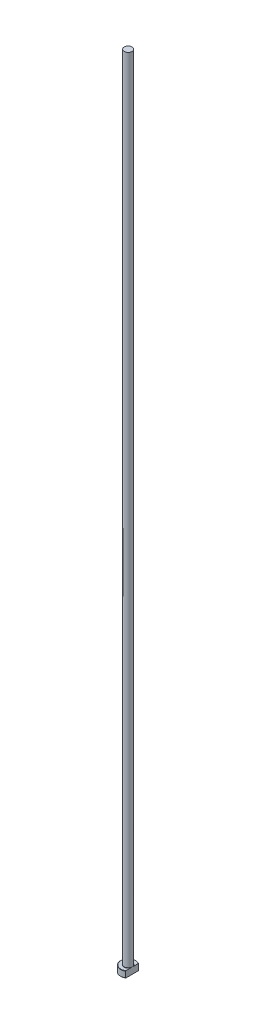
ISO-10303-21;
HEADER;
FILE_DESCRIPTION(('STEP AP214'),'2;1');
FILE_NAME('part.step','',(''),(''),'','','');
FILE_SCHEMA(('AUTOMOTIVE_DESIGN { 1 0 10303 214 1 1 1 1 }'));
ENDSEC;
DATA;
#1=APPLICATION_CONTEXT('core data for automotive mechanical design processes');
#2=APPLICATION_PROTOCOL_DEFINITION('international standard','automotive_design',2000,#1);
#3=PRODUCT_CONTEXT('',#1,'mechanical');
#4=PRODUCT('Part','Part','',(#3));
#5=PRODUCT_RELATED_PRODUCT_CATEGORY('part','',(#4));
#6=PRODUCT_DEFINITION_FORMATION('','',#4);
#7=PRODUCT_DEFINITION_CONTEXT('part definition',#1,'design');
#8=PRODUCT_DEFINITION('design','',#6,#7);
#9=PRODUCT_DEFINITION_SHAPE('','',#8);
#10=(LENGTH_UNIT() NAMED_UNIT(*) SI_UNIT(.MILLI.,.METRE.));
#11=(NAMED_UNIT(*) PLANE_ANGLE_UNIT() SI_UNIT($,.RADIAN.));
#12=(NAMED_UNIT(*) SI_UNIT($,.STERADIAN.) SOLID_ANGLE_UNIT());
#13=UNCERTAINTY_MEASURE_WITH_UNIT(LENGTH_MEASURE(1.E-05),#10,'distance_accuracy_value','');
#14=(GEOMETRIC_REPRESENTATION_CONTEXT(3) GLOBAL_UNCERTAINTY_ASSIGNED_CONTEXT((#13)) GLOBAL_UNIT_ASSIGNED_CONTEXT((#10,
#11,#12)) REPRESENTATION_CONTEXT('',''));
#15=CARTESIAN_POINT('',(0.,0.,0.));
#16=DIRECTION('',(0.,0.,1.));
#17=DIRECTION('',(1.,0.,0.));
#18=AXIS2_PLACEMENT_3D('',#15,#16,#17);
#19=CARTESIAN_POINT('',(0.,0.,0.));
#20=DIRECTION('',(0.,-1.,0.));
#21=DIRECTION('',(0.,0.,-1.));
#22=AXIS2_PLACEMENT_3D('',#19,#20,#21);
#23=PLANE('',#22);
#24=CARTESIAN_POINT('',(0.,0.,0.));
#25=DIRECTION('',(0.,-1.,0.));
#26=DIRECTION('',(0.,0.,-1.));
#27=AXIS2_PLACEMENT_3D('',#24,#25,#26);
#28=CIRCLE('',#27,5.79999999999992);
#29=CARTESIAN_POINT('',(3.09999999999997,0.,4.90204039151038));
#30=VERTEX_POINT('',#29);
#31=CARTESIAN_POINT('',(3.09999999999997,0.,-4.90204039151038));
#32=VERTEX_POINT('',#31);
#33=EDGE_CURVE('E98',#30,#32,#28,.T.);
#34=ORIENTED_EDGE('',*,*,#33,.T.);
#35=DIRECTION('',(0.,0.,1.));
#36=VECTOR('',#35,1.);
#37=CARTESIAN_POINT('',(3.09999999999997,0.,-5.13711981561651));
#38=LINE('',#37,#36);
#39=EDGE_CURVE('E83',#32,#30,#38,.T.);
#40=ORIENTED_EDGE('',*,*,#39,.T.);
#41=EDGE_LOOP('',(#34,#40));
#42=FACE_BOUND('',#41,.T.);
#43=ADVANCED_FACE('F32',(#42),#23,.T.);
#44=CARTESIAN_POINT('',(0.,259.958771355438,0.));
#45=DIRECTION('',(0.,1.,0.));
#46=DIRECTION('',(0.,0.,1.));
#47=AXIS2_PLACEMENT_3D('',#44,#45,#46);
#48=CYLINDRICAL_SURFACE('',#47,5.99999999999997);
#49=CARTESIAN_POINT('',(0.,4.80000000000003,0.));
#50=DIRECTION('',(0.,1.,0.));
#51=DIRECTION('',(0.,0.,1.));
#52=AXIS2_PLACEMENT_3D('',#49,#50,#51);
#53=CIRCLE('',#52,5.99999999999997);
#54=CARTESIAN_POINT('',(3.09999999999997,4.80000000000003,5.13711981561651));
#55=VERTEX_POINT('',#54);
#56=CARTESIAN_POINT('',(3.09999999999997,4.80000000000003,-5.13711981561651));
#57=VERTEX_POINT('',#56);
#58=EDGE_CURVE('E104',#55,#57,#53,.F.);
#59=ORIENTED_EDGE('',*,*,#58,.T.);
#60=DIRECTION('',(0.,-1.,0.));
#61=VECTOR('',#60,1.);
#62=CARTESIAN_POINT('',(3.09999999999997,630.,-5.13711981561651));
#63=LINE('',#62,#61);
#64=CARTESIAN_POINT('',(3.09999999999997,0.200000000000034,-5.13711981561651));
#65=VERTEX_POINT('',#64);
#66=EDGE_CURVE('E183',#57,#65,#63,.T.);
#67=ORIENTED_EDGE('',*,*,#66,.T.);
#68=CARTESIAN_POINT('',(0.,0.200000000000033,0.));
#69=DIRECTION('',(0.,-1.,0.));
#70=DIRECTION('',(0.,0.,-1.));
#71=AXIS2_PLACEMENT_3D('',#68,#69,#70);
#72=CIRCLE('',#71,5.99999999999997);
#73=CARTESIAN_POINT('',(3.09999999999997,0.200000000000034,5.13711981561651));
#74=VERTEX_POINT('',#73);
#75=EDGE_CURVE('E100',#65,#74,#72,.F.);
#76=ORIENTED_EDGE('',*,*,#75,.T.);
#77=DIRECTION('',(0.,-1.,0.));
#78=VECTOR('',#77,1.);
#79=CARTESIAN_POINT('',(3.09999999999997,630.,5.13711981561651));
#80=LINE('',#79,#78);
#81=EDGE_CURVE('E93',#55,#74,#80,.T.);
#82=ORIENTED_EDGE('',*,*,#81,.F.);
#83=EDGE_LOOP('',(#59,#67,#76,#82));
#84=FACE_BOUND('',#83,.T.);
#85=ADVANCED_FACE('F158',(#84),#48,.T.);
#86=CARTESIAN_POINT('',(-5.99999999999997,5.,0.));
#87=DIRECTION('',(0.,1.,0.));
#88=DIRECTION('',(0.,0.,1.));
#89=AXIS2_PLACEMENT_3D('',#86,#87,#88);
#90=PLANE('',#89);
#91=CARTESIAN_POINT('',(0.,5.,0.));
#92=DIRECTION('',(0.,1.,0.));
#93=DIRECTION('',(0.,0.,1.));
#94=AXIS2_PLACEMENT_3D('',#91,#92,#93);
#95=CIRCLE('',#94,5.79999999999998);
#96=CARTESIAN_POINT('',(3.09999999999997,5.,-4.90204039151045));
#97=VERTEX_POINT('',#96);
#98=CARTESIAN_POINT('',(3.09999999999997,5.,4.90204039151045));
#99=VERTEX_POINT('',#98);
#100=EDGE_CURVE('E178',#97,#99,#95,.T.);
#101=ORIENTED_EDGE('',*,*,#100,.T.);
#102=DIRECTION('',(0.,0.,-1.));
#103=VECTOR('',#102,1.);
#104=CARTESIAN_POINT('',(3.09999999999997,5.,0.));
#105=LINE('',#104,#103);
#106=CARTESIAN_POINT('',(3.09999999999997,4.99999999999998,1.13137084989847));
#107=VERTEX_POINT('',#106);
#108=EDGE_CURVE('E57',#99,#107,#105,.T.);
#109=ORIENTED_EDGE('',*,*,#108,.T.);
#110=CARTESIAN_POINT('',(0.,5.,0.));
#111=DIRECTION('',(0.,1.,0.));
#112=DIRECTION('',(0.,0.,1.));
#113=AXIS2_PLACEMENT_3D('',#110,#111,#112);
#114=CIRCLE('',#113,3.29999999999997);
#115=CARTESIAN_POINT('',(3.09999999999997,4.99999999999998,-1.13137084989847));
#116=VERTEX_POINT('',#115);
#117=EDGE_CURVE('E107',#107,#116,#114,.F.);
#118=ORIENTED_EDGE('',*,*,#117,.T.);
#119=EDGE_CURVE('E136',#116,#97,#105,.T.);
#120=ORIENTED_EDGE('',*,*,#119,.T.);
#121=EDGE_LOOP('',(#101,#109,#118,#120));
#122=FACE_BOUND('',#121,.T.);
#123=ADVANCED_FACE('F147',(#122),#90,.T.);
#124=CARTESIAN_POINT('',(0.,5.,0.));
#125=DIRECTION('',(0.,-1.,0.));
#126=DIRECTION('',(0.,0.,-1.));
#127=AXIS2_PLACEMENT_3D('',#124,#125,#126);
#128=CONICAL_SURFACE('',#127,5.79999999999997,0.785398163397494);
#129=ORIENTED_EDGE('',*,*,#58,.F.);
#130=CARTESIAN_POINT('',(3.09999999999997,-0.920431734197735,11.3030314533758));
#131=CARTESIAN_POINT('',(3.09999999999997,-0.688619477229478,11.0626468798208));
#132=CARTESIAN_POINT('',(3.09999999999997,-0.457063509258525,10.8220144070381));
#133=CARTESIAN_POINT('',(3.09999999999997,0.00539791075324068,10.3401205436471));
#134=CARTESIAN_POINT('',(3.09999999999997,0.236303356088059,10.0988591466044));
#135=CARTESIAN_POINT('',(3.09999999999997,0.69741098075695,9.61548494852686));
#136=CARTESIAN_POINT('',(3.09999999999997,0.927612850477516,9.3733718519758));
#137=CARTESIAN_POINT('',(3.09999999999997,1.38702344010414,8.88820676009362));
#138=CARTESIAN_POINT('',(3.09999999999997,1.61623216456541,8.64515476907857));
#139=CARTESIAN_POINT('',(3.09999999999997,2.06943803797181,8.16208218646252));
#140=CARTESIAN_POINT('',(3.09999999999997,2.29345676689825,7.92208185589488));
#141=CARTESIAN_POINT('',(3.09999999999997,2.73992554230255,7.4406269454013));
#142=CARTESIAN_POINT('',(3.09999999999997,2.96237559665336,7.19917237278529));
#143=CARTESIAN_POINT('',(3.09999999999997,3.40516728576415,6.71440911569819));
#144=CARTESIAN_POINT('',(3.09999999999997,3.6255092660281,6.47110074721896));
#145=CARTESIAN_POINT('',(3.09999999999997,4.06338097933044,5.98197014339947));
#146=CARTESIAN_POINT('',(3.09999999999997,4.28091078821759,5.736147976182));
#147=CARTESIAN_POINT('',(3.09999999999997,4.64723250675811,5.31542741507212));
#148=CARTESIAN_POINT('',(3.09999999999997,4.79703819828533,5.14141294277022));
#149=CARTESIAN_POINT('',(3.09999999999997,5.09412273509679,4.7912056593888));
#150=CARTESIAN_POINT('',(3.09999999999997,5.24140133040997,4.61501263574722));
#151=CARTESIAN_POINT('',(3.09999999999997,5.5340047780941,4.25808346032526));
#152=CARTESIAN_POINT('',(3.09999999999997,5.67929603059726,4.07731963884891));
#153=CARTESIAN_POINT('',(3.09999999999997,5.96506147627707,3.71208453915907));
#154=CARTESIAN_POINT('',(3.09999999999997,6.10553688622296,3.52761421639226));
#155=CARTESIAN_POINT('',(3.09999999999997,6.38162972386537,3.15098880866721));
#156=CARTESIAN_POINT('',(3.09999999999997,6.5171507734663,2.95876205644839));
#157=CARTESIAN_POINT('',(3.09999999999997,6.71260042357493,2.66498269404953));
#158=CARTESIAN_POINT('',(3.09999999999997,6.77649142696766,2.56607098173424));
#159=CARTESIAN_POINT('',(3.09999999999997,6.90093996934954,2.36617934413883));
#160=CARTESIAN_POINT('',(3.09999999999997,6.96149785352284,2.26519963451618));
#161=CARTESIAN_POINT('',(3.09999999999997,7.07778312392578,2.06197879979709));
#162=CARTESIAN_POINT('',(3.09999999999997,7.13355741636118,1.9597648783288));
#163=CARTESIAN_POINT('',(3.09999999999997,7.23993773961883,1.75269687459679));
#164=CARTESIAN_POINT('',(3.09999999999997,7.29054278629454,1.64784229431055));
#165=CARTESIAN_POINT('',(3.09999999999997,7.43232844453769,1.329374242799));
#166=CARTESIAN_POINT('',(3.09999999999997,7.51393038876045,1.11110705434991));
#167=CARTESIAN_POINT('',(3.09999999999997,7.60389052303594,0.78418122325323));
#168=CARTESIAN_POINT('',(3.09999999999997,7.62802295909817,0.679829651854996));
#169=CARTESIAN_POINT('',(3.09999999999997,7.66638713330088,0.46928482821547));
#170=CARTESIAN_POINT('',(3.09999999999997,7.68061997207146,0.363091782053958));
#171=CARTESIAN_POINT('',(3.09999999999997,7.69816738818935,0.150218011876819));
#172=CARTESIAN_POINT('',(3.09999999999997,7.70152516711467,0.0435409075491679));
#173=CARTESIAN_POINT('',(3.09999999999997,7.69719360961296,-0.169591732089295));
#174=CARTESIAN_POINT('',(3.09999999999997,7.68950359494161,-0.276047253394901));
#175=CARTESIAN_POINT('',(3.09999999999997,7.66373252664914,-0.486880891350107));
#176=CARTESIAN_POINT('',(3.09999999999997,7.64572733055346,-0.591268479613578));
#177=CARTESIAN_POINT('',(3.09999999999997,7.60052536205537,-0.798013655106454));
#178=CARTESIAN_POINT('',(3.09999999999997,7.57332729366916,-0.900370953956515));
#179=CARTESIAN_POINT('',(3.09999999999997,7.51094394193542,-1.10330613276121));
#180=CARTESIAN_POINT('',(3.09999999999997,7.47570859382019,-1.20386840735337));
#181=CARTESIAN_POINT('',(3.09999999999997,7.39875968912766,-1.40242722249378));
#182=CARTESIAN_POINT('',(3.09999999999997,7.35704736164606,-1.50042424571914));
#183=CARTESIAN_POINT('',(3.09999999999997,7.22811120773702,-1.78198575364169));
#184=CARTESIAN_POINT('',(3.09999999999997,7.13397777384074,-1.96237556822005));
#185=CARTESIAN_POINT('',(3.09999999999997,6.93309444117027,-2.31605883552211));
#186=CARTESIAN_POINT('',(3.09999999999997,6.82632930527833,-2.48934337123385));
#187=CARTESIAN_POINT('',(3.09999999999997,6.60386158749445,-2.83097436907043));
#188=CARTESIAN_POINT('',(3.09999999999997,6.48812633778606,-2.99929937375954));
#189=CARTESIAN_POINT('',(3.09999999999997,6.2507350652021,-3.33155975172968));
#190=CARTESIAN_POINT('',(3.09999999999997,6.12908188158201,-3.49549717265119));
#191=CARTESIAN_POINT('',(3.09999999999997,5.87989164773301,-3.82213838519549));
#192=CARTESIAN_POINT('',(3.09999999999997,5.75229938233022,-3.98479985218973));
#193=CARTESIAN_POINT('',(3.09999999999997,5.49383773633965,-4.30751445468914));
#194=CARTESIAN_POINT('',(3.09999999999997,5.36296802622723,-4.46756732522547));
#195=CARTESIAN_POINT('',(3.09999999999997,5.09906242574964,-4.78523580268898));
#196=CARTESIAN_POINT('',(3.09999999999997,4.96603235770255,-4.94285625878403));
#197=CARTESIAN_POINT('',(3.09999999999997,4.69805373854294,-5.25645943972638));
#198=CARTESIAN_POINT('',(3.09999999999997,4.56310515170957,-5.41244213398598));
#199=CARTESIAN_POINT('',(3.09999999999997,4.2080943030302,-5.81877937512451));
#200=CARTESIAN_POINT('',(3.09999999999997,3.98681570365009,-6.06807041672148));
#201=CARTESIAN_POINT('',(3.09999999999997,3.54147161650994,-6.56415415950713));
#202=CARTESIAN_POINT('',(3.09999999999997,3.31740605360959,-6.8109467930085));
#203=CARTESIAN_POINT('',(3.09999999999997,2.86701901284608,-7.30287446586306));
#204=CARTESIAN_POINT('',(3.09999999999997,2.64069567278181,-7.54800779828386));
#205=CARTESIAN_POINT('',(3.09999999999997,2.18649425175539,-8.0368296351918));
#206=CARTESIAN_POINT('',(3.09999999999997,1.95861616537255,-8.28051813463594));
#207=CARTESIAN_POINT('',(3.09999999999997,1.5108345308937,-8.75699429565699));
#208=CARTESIAN_POINT('',(3.09999999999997,1.29097841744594,-8.98982656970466));
#209=CARTESIAN_POINT('',(3.09999999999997,0.850379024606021,-9.4546514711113));
#210=CARTESIAN_POINT('',(3.09999999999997,0.629635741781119,-9.68664409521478));
#211=CARTESIAN_POINT('',(3.09999999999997,0.187673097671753,-10.1496925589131));
#212=CARTESIAN_POINT('',(3.09999999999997,-0.0335454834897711,-10.3807491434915));
#213=CARTESIAN_POINT('',(3.09999999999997,-0.476574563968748,-10.8422904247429));
#214=CARTESIAN_POINT('',(3.09999999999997,-0.698385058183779,-11.0727751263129));
#215=CARTESIAN_POINT('',(3.09999999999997,-0.920431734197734,-11.3030314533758));
#216=B_SPLINE_CURVE_WITH_KNOTS('',3,(#130,#131,#132,#133,#134,#135,#136,#137,#138,#139,#140,
#141,#142,#143,#144,#145,#146,#147,#148,#149,#150,#151,#152,#153,#154,#155,#156,#157,#158,#159,
#160,#161,#162,#163,#164,#165,#166,#167,#168,#169,#170,#171,#172,#173,#174,#175,#176,#177,#178,
#179,#180,#181,#182,#183,#184,#185,#186,#187,#188,#189,#190,#191,#192,#193,#194,#195,#196,#197,
#198,#199,#200,#201,#202,#203,#204,#205,#206,#207,#208,#209,#210,#211,#212,#213,#214,#215),
.UNSPECIFIED.,.F.,.F.,(4,2,2,2,2,2,2,2,2,2,2,2,2,2,2,2,2,2,2,2,2,2,2,2,2,2,2,2,2,2,2,2,2,2,2,2,
2,2,2,2,2,2,4),(0.,1.00184641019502,2.00370311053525,3.00595078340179,4.00819385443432,
4.9931053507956,5.97801190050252,6.9627541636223,7.94746981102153,8.6362949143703,
9.32518776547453,10.0208755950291,10.7163863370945,11.421700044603,11.7749044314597,
12.1280721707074,12.4772435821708,12.8264813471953,13.5223439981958,13.8432758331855,
14.1641719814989,14.4837917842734,14.8034312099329,15.1207496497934,15.4381128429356,
15.7575096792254,16.0768459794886,16.6863983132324,17.296693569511,17.9093265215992,
18.5216683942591,19.1418114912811,19.7620171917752,20.3807633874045,20.9995211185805,
21.9994842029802,22.9994743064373,24.0003716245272,25.0012724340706,25.961961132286,
26.9226535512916,27.882299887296,28.8419379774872),.UNSPECIFIED.);
#217=EDGE_CURVE('E135',#55,#99,#216,.T.);
#218=ORIENTED_EDGE('',*,*,#217,.T.);
#219=ORIENTED_EDGE('',*,*,#100,.F.);
#220=EDGE_CURVE('E127',#97,#57,#216,.T.);
#221=ORIENTED_EDGE('',*,*,#220,.T.);
#222=EDGE_LOOP('',(#129,#218,#219,#221));
#223=FACE_BOUND('',#222,.T.);
#224=ADVANCED_FACE('F143',(#223),#128,.T.);
#225=CARTESIAN_POINT('',(0.,0.200000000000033,0.));
#226=DIRECTION('',(0.,1.,0.));
#227=DIRECTION('',(0.,0.,1.));
#228=AXIS2_PLACEMENT_3D('',#225,#226,#227);
#229=CONICAL_SURFACE('',#228,5.99999999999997,0.785398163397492);
#230=ORIENTED_EDGE('',*,*,#75,.F.);
#231=CARTESIAN_POINT('',(3.09999999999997,5.92043173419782,-11.3030314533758));
#232=CARTESIAN_POINT('',(3.09999999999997,5.68861947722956,-11.0626468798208));
#233=CARTESIAN_POINT('',(3.09999999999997,5.45706350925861,-10.8220144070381));
#234=CARTESIAN_POINT('',(3.09999999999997,4.99460208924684,-10.3401205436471));
#235=CARTESIAN_POINT('',(3.09999999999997,4.76369664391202,-10.0988591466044));
#236=CARTESIAN_POINT('',(3.09999999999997,4.30258901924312,-9.61548494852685));
#237=CARTESIAN_POINT('',(3.09999999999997,4.07238714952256,-9.37337185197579));
#238=CARTESIAN_POINT('',(3.09999999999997,3.61297655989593,-8.88820676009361));
#239=CARTESIAN_POINT('',(3.09999999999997,3.38376783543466,-8.64515476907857));
#240=CARTESIAN_POINT('',(3.09999999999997,2.93056196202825,-8.16208218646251));
#241=CARTESIAN_POINT('',(3.09999999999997,2.70654323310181,-7.92208185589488));
#242=CARTESIAN_POINT('',(3.09999999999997,2.26007445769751,-7.4406269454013));
#243=CARTESIAN_POINT('',(3.09999999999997,2.03762440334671,-7.19917237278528));
#244=CARTESIAN_POINT('',(3.09999999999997,1.5948327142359,-6.71440911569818));
#245=CARTESIAN_POINT('',(3.09999999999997,1.37449073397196,-6.47110074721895));
#246=CARTESIAN_POINT('',(3.09999999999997,0.936619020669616,-5.98197014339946));
#247=CARTESIAN_POINT('',(3.09999999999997,0.719089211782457,-5.73614797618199));
#248=CARTESIAN_POINT('',(3.09999999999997,0.352767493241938,-5.31542741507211));
#249=CARTESIAN_POINT('',(3.09999999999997,0.202961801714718,-5.14141294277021));
#250=CARTESIAN_POINT('',(3.09999999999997,-0.0941227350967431,-4.79120565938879));
#251=CARTESIAN_POINT('',(3.09999999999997,-0.241401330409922,-4.61501263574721));
#252=CARTESIAN_POINT('',(3.09999999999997,-0.534004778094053,-4.25808346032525));
#253=CARTESIAN_POINT('',(3.09999999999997,-0.679296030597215,-4.0773196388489));
#254=CARTESIAN_POINT('',(3.09999999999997,-0.965061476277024,-3.71208453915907));
#255=CARTESIAN_POINT('',(3.09999999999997,-1.10553688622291,-3.52761421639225));
#256=CARTESIAN_POINT('',(3.09999999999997,-1.38162972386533,-3.1509888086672));
#257=CARTESIAN_POINT('',(3.09999999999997,-1.51715077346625,-2.95876205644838));
#258=CARTESIAN_POINT('',(3.09999999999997,-1.71260042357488,-2.66498269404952));
#259=CARTESIAN_POINT('',(3.09999999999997,-1.77649142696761,-2.56607098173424));
#260=CARTESIAN_POINT('',(3.09999999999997,-1.90093996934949,-2.36617934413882));
#261=CARTESIAN_POINT('',(3.09999999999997,-1.96149785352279,-2.26519963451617));
#262=CARTESIAN_POINT('',(3.09999999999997,-2.07778312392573,-2.06197879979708));
#263=CARTESIAN_POINT('',(3.09999999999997,-2.13355741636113,-1.95976487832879));
#264=CARTESIAN_POINT('',(3.09999999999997,-2.23993773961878,-1.75269687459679));
#265=CARTESIAN_POINT('',(3.09999999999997,-2.29054278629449,-1.64784229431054));
#266=CARTESIAN_POINT('',(3.09999999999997,-2.43232844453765,-1.32937424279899));
#267=CARTESIAN_POINT('',(3.09999999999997,-2.5139303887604,-1.1111070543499));
#268=CARTESIAN_POINT('',(3.09999999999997,-2.60389052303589,-0.784181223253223));
#269=CARTESIAN_POINT('',(3.09999999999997,-2.62802295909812,-0.67982965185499));
#270=CARTESIAN_POINT('',(3.09999999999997,-2.66638713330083,-0.469284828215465));
#271=CARTESIAN_POINT('',(3.09999999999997,-2.68061997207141,-0.363091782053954));
#272=CARTESIAN_POINT('',(3.09999999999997,-2.6981673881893,-0.150218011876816));
#273=CARTESIAN_POINT('',(3.09999999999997,-2.70152516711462,-0.0435409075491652));
#274=CARTESIAN_POINT('',(3.09999999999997,-2.69719360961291,0.169591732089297));
#275=CARTESIAN_POINT('',(3.09999999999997,-2.68950359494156,0.276047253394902));
#276=CARTESIAN_POINT('',(3.09999999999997,-2.66373252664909,0.486880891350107));
#277=CARTESIAN_POINT('',(3.09999999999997,-2.64572733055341,0.591268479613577));
#278=CARTESIAN_POINT('',(3.09999999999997,-2.60052536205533,0.798013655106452));
#279=CARTESIAN_POINT('',(3.09999999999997,-2.57332729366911,0.900370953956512));
#280=CARTESIAN_POINT('',(3.09999999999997,-2.51094394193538,1.10330613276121));
#281=CARTESIAN_POINT('',(3.09999999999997,-2.47570859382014,1.20386840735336));
#282=CARTESIAN_POINT('',(3.09999999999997,-2.39875968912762,1.40242722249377));
#283=CARTESIAN_POINT('',(3.09999999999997,-2.35704736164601,1.50042424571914));
#284=CARTESIAN_POINT('',(3.09999999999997,-2.22811120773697,1.78198575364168));
#285=CARTESIAN_POINT('',(3.09999999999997,-2.1339777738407,1.96237556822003));
#286=CARTESIAN_POINT('',(3.09999999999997,-1.93309444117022,2.31605883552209));
#287=CARTESIAN_POINT('',(3.09999999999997,-1.82632930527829,2.48934337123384));
#288=CARTESIAN_POINT('',(3.09999999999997,-1.60386158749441,2.83097436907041));
#289=CARTESIAN_POINT('',(3.09999999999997,-1.48812633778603,2.99929937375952));
#290=CARTESIAN_POINT('',(3.09999999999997,-1.25073506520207,3.33155975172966));
#291=CARTESIAN_POINT('',(3.09999999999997,-1.12908188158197,3.49549717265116));
#292=CARTESIAN_POINT('',(3.09999999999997,-0.879891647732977,3.82213838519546));
#293=CARTESIAN_POINT('',(3.09999999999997,-0.752299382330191,3.9847998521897));
#294=CARTESIAN_POINT('',(3.09999999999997,-0.493837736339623,4.3075144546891));
#295=CARTESIAN_POINT('',(3.09999999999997,-0.362968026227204,4.46756732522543));
#296=CARTESIAN_POINT('',(3.09999999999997,-0.0990624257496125,4.78523580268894));
#297=CARTESIAN_POINT('',(3.09999999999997,0.0339676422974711,4.94285625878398));
#298=CARTESIAN_POINT('',(3.09999999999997,0.301946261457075,5.25645943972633));
#299=CARTESIAN_POINT('',(3.09999999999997,0.436894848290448,5.41244213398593));
#300=CARTESIAN_POINT('',(3.09999999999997,0.791905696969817,5.81877937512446));
#301=CARTESIAN_POINT('',(3.09999999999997,1.01318429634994,6.06807041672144));
#302=CARTESIAN_POINT('',(3.09999999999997,1.45852838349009,6.56415415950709));
#303=CARTESIAN_POINT('',(3.09999999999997,1.68259394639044,6.81094679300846));
#304=CARTESIAN_POINT('',(3.09999999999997,2.13298098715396,7.30287446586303));
#305=CARTESIAN_POINT('',(3.09999999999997,2.35930432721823,7.54800779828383));
#306=CARTESIAN_POINT('',(3.09999999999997,2.81350574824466,8.03682963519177));
#307=CARTESIAN_POINT('',(3.09999999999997,3.0413838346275,8.28051813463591));
#308=CARTESIAN_POINT('',(3.09999999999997,3.48916546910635,8.75699429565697));
#309=CARTESIAN_POINT('',(3.09999999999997,3.70902158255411,8.98982656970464));
#310=CARTESIAN_POINT('',(3.09999999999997,4.14962097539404,9.45465147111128));
#311=CARTESIAN_POINT('',(3.09999999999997,4.37036425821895,9.68664409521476));
#312=CARTESIAN_POINT('',(3.09999999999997,4.81232690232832,10.1496925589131));
#313=CARTESIAN_POINT('',(3.09999999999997,5.03354548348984,10.3807491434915));
#314=CARTESIAN_POINT('',(3.09999999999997,5.47657456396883,10.8422904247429));
#315=CARTESIAN_POINT('',(3.09999999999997,5.69838505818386,11.0727751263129));
#316=CARTESIAN_POINT('',(3.09999999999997,5.92043173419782,11.3030314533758));
#317=B_SPLINE_CURVE_WITH_KNOTS('',3,(#231,#232,#233,#234,#235,#236,#237,#238,#239,#240,#241,
#242,#243,#244,#245,#246,#247,#248,#249,#250,#251,#252,#253,#254,#255,#256,#257,#258,#259,#260,
#261,#262,#263,#264,#265,#266,#267,#268,#269,#270,#271,#272,#273,#274,#275,#276,#277,#278,#279,
#280,#281,#282,#283,#284,#285,#286,#287,#288,#289,#290,#291,#292,#293,#294,#295,#296,#297,#298,
#299,#300,#301,#302,#303,#304,#305,#306,#307,#308,#309,#310,#311,#312,#313,#314,#315,#316),
.UNSPECIFIED.,.F.,.F.,(4,2,2,2,2,2,2,2,2,2,2,2,2,2,2,2,2,2,2,2,2,2,2,2,2,2,2,2,2,2,2,2,2,2,2,2,
2,2,2,2,2,2,4),(0.,1.00184641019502,2.00370311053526,3.0059507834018,4.00819385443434,
4.99310535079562,5.97801190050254,6.96275416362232,7.94746981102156,8.63629491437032,
9.32518776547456,10.0208755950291,10.7163863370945,11.421700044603,11.7749044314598,
12.1280721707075,12.4772435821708,12.8264813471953,13.5223439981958,13.8432758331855,
14.1641719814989,14.4837917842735,14.8034312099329,15.1207496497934,15.4381128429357,
15.7575096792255,16.0768459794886,16.6863983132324,17.296693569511,17.9093265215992,
18.5216683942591,19.1418114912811,19.7620171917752,20.3807633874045,20.9995211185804,
21.9994842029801,22.9994743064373,24.0003716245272,25.0012724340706,25.961961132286,
26.9226535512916,27.8822998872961,28.8419379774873),.UNSPECIFIED.);
#318=EDGE_CURVE('E86',#65,#32,#317,.T.);
#319=ORIENTED_EDGE('',*,*,#318,.T.);
#320=ORIENTED_EDGE('',*,*,#33,.F.);
#321=EDGE_CURVE('E89',#30,#74,#317,.T.);
#322=ORIENTED_EDGE('',*,*,#321,.T.);
#323=EDGE_LOOP('',(#230,#319,#320,#322));
#324=FACE_BOUND('',#323,.T.);
#325=ADVANCED_FACE('F97',(#324),#229,.T.);
#326=CARTESIAN_POINT('',(0.,5.19999999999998,0.));
#327=DIRECTION('',(0.,1.,0.));
#328=DIRECTION('',(0.,0.,1.));
#329=AXIS2_PLACEMENT_3D('',#326,#327,#328);
#330=TOROIDAL_SURFACE('',#329,3.29999999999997,0.2);
#331=CARTESIAN_POINT('',(3.09999999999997,5.19999999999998,0.));
#332=CARTESIAN_POINT('',(3.09999999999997,5.20000050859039,8.63470448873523E-11));
#333=CARTESIAN_POINT('',(3.09999999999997,5.20000101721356,-1.96831350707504E-07));
#334=CARTESIAN_POINT('',(3.09999999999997,5.20000196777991,-7.43387548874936E-07));
#335=CARTESIAN_POINT('',(3.09999999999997,5.20000239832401,-1.10608751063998E-06));
#336=CARTESIAN_POINT('',(3.09999999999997,5.20000329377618,-1.97482885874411E-06));
#337=CARTESIAN_POINT('',(3.09999999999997,5.20000374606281,-2.49491365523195E-06));
#338=CARTESIAN_POINT('',(3.09999999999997,5.20000455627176,-3.57320004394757E-06));
#339=CARTESIAN_POINT('',(3.09999999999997,5.20000491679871,-4.12959627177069E-06));
#340=CARTESIAN_POINT('',(3.09999999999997,5.20000625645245,-6.28443543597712E-06));
#341=CARTESIAN_POINT('',(3.09999999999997,5.20000716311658,-7.93057681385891E-06));
#342=CARTESIAN_POINT('',(3.09999999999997,5.20000865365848,-1.11908861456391E-05));
#343=CARTESIAN_POINT('',(3.09999999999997,5.20000925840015,-1.27959111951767E-05));
#344=CARTESIAN_POINT('',(3.09999999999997,5.20001179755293,-1.95895744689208E-05));
#345=CARTESIAN_POINT('',(3.09999999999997,5.20001369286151,-2.47960258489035E-05));
#346=CARTESIAN_POINT('',(3.09999999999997,5.20001648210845,-3.46313916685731E-05));
#347=CARTESIAN_POINT('',(3.09999999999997,5.20001748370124,-3.9229578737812E-05));
#348=CARTESIAN_POINT('',(3.09999999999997,5.20002478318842,-7.34062169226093E-05));
#349=CARTESIAN_POINT('',(3.09999999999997,5.20003031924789,-0.000103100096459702));
#350=CARTESIAN_POINT('',(3.09999999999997,5.20005455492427,-0.000220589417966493));
#351=CARTESIAN_POINT('',(3.09999999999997,5.2000776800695,-0.000307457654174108));
#352=CARTESIAN_POINT('',(3.09999999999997,5.20016786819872,-0.000651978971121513));
#353=CARTESIAN_POINT('',(3.09999999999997,5.20023206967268,-0.000910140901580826));
#354=CARTESIAN_POINT('',(3.09999999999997,5.2004894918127,-0.00193760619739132));
#355=CARTESIAN_POINT('',(3.09999999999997,5.20068632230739,-0.00270624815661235));
#356=CARTESIAN_POINT('',(3.09999999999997,5.20150547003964,-0.00591366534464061));
#357=CARTESIAN_POINT('',(3.09999999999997,5.20212323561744,-0.00835327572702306));
#358=CARTESIAN_POINT('',(3.09999999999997,5.2072994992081,-0.0287840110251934));
#359=CARTESIAN_POINT('',(3.09999999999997,5.21187465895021,-0.046772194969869));
#360=CARTESIAN_POINT('',(3.09999999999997,5.22081406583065,-0.0820386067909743));
#361=CARTESIAN_POINT('',(3.09999999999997,5.22517945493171,-0.0993165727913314));
#362=CARTESIAN_POINT('',(3.09999999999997,5.23938711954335,-0.155760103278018));
#363=CARTESIAN_POINT('',(3.09999999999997,5.24916620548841,-0.19494192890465));
#364=CARTESIAN_POINT('',(3.09999999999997,5.26559812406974,-0.262010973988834));
#365=CARTESIAN_POINT('',(3.09999999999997,5.27233495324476,-0.289877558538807));
#366=CARTESIAN_POINT('',(3.09999999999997,5.28539894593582,-0.344925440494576));
#367=CARTESIAN_POINT('',(3.09999999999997,5.2917322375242,-0.372105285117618));
#368=CARTESIAN_POINT('',(3.09999999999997,5.3104657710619,-0.454441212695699));
#369=CARTESIAN_POINT('',(3.09999999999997,5.32242624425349,-0.509699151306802));
#370=CARTESIAN_POINT('',(3.09999999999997,5.34470875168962,-0.621095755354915));
#371=CARTESIAN_POINT('',(3.09999999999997,5.35501420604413,-0.677237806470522));
#372=CARTESIAN_POINT('',(3.09999999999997,5.37397233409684,-0.795308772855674));
#373=CARTESIAN_POINT('',(3.09999999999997,5.38237372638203,-0.857279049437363));
#374=CARTESIAN_POINT('',(3.09999999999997,5.39483964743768,-0.981488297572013));
#375=CARTESIAN_POINT('',(3.09999999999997,5.39891956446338,-1.04372551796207));
#376=CARTESIAN_POINT('',(3.09999999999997,5.4002522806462,-1.1364625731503));
#377=CARTESIAN_POINT('',(3.09999999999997,5.39992868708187,-1.16692514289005));
#378=CARTESIAN_POINT('',(3.09999999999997,5.39736890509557,-1.22783403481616));
#379=CARTESIAN_POINT('',(3.09999999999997,5.39512949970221,-1.25828024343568));
#380=CARTESIAN_POINT('',(3.09999999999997,5.3882758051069,-1.31816284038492));
#381=CARTESIAN_POINT('',(3.09999999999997,5.38372059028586,-1.34760578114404));
#382=CARTESIAN_POINT('',(3.09999999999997,5.37149785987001,-1.40581436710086));
#383=CARTESIAN_POINT('',(3.09999999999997,5.36383981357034,-1.43458179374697));
#384=CARTESIAN_POINT('',(3.09999999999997,5.34913051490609,-1.47610977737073));
#385=CARTESIAN_POINT('',(3.09999999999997,5.34380195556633,-1.48947638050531));
#386=CARTESIAN_POINT('',(3.09999999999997,5.33179609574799,-1.51565425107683));
#387=CARTESIAN_POINT('',(3.09999999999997,5.32511527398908,-1.52846396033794));
#388=CARTESIAN_POINT('',(3.09999999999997,5.31156812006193,-1.55058530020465));
#389=CARTESIAN_POINT('',(3.09999999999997,5.30500876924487,-1.56008264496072));
#390=CARTESIAN_POINT('',(3.09999999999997,5.29056237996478,-1.5780097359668));
#391=CARTESIAN_POINT('',(3.09999999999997,5.28267975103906,-1.58644287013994));
#392=CARTESIAN_POINT('',(3.09999999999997,5.26899499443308,-1.59836257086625));
#393=CARTESIAN_POINT('',(3.09999999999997,5.26370979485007,-1.60243897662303));
#394=CARTESIAN_POINT('',(3.09999999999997,5.25259769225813,-1.60977856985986));
#395=CARTESIAN_POINT('',(3.09999999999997,5.24677147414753,-1.61304276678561));
#396=CARTESIAN_POINT('',(3.09999999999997,5.23558966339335,-1.61807105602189));
#397=CARTESIAN_POINT('',(3.09999999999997,5.23030479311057,-1.61999055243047));
#398=CARTESIAN_POINT('',(3.09999999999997,5.21948724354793,-1.62291762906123));
#399=CARTESIAN_POINT('',(3.09999999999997,5.21395478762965,-1.62392601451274));
#400=CARTESIAN_POINT('',(3.09999999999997,5.20277366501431,-1.62493544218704));
#401=CARTESIAN_POINT('',(3.09999999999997,5.19712461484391,-1.62493233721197));
#402=CARTESIAN_POINT('',(3.09999999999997,5.18591949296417,-1.62390846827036));
#403=CARTESIAN_POINT('',(3.09999999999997,5.1803634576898,-1.62288731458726));
#404=CARTESIAN_POINT('',(3.09999999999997,5.16982009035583,-1.62001450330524));
#405=CARTESIAN_POINT('',(3.09999999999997,5.16481843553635,-1.61821408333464));
#406=CARTESIAN_POINT('',(3.09999999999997,5.15512149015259,-1.61392929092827));
#407=CARTESIAN_POINT('',(3.09999999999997,5.15042629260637,-1.61144471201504));
#408=CARTESIAN_POINT('',(3.09999999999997,5.13843536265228,-1.60413057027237));
#409=CARTESIAN_POINT('',(3.09999999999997,5.13143004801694,-1.59882575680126));
#410=CARTESIAN_POINT('',(3.09999999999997,5.11831643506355,-1.5871999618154));
#411=CARTESIAN_POINT('',(3.09999999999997,5.1122112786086,-1.58087557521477));
#412=CARTESIAN_POINT('',(3.09999999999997,5.09648912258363,-1.56251896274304));
#413=CARTESIAN_POINT('',(3.09999999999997,5.08770172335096,-1.54978301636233));
#414=CARTESIAN_POINT('',(3.09999999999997,5.07201622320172,-1.52323986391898));
#415=CARTESIAN_POINT('',(3.09999999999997,5.06512028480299,-1.50943145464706));
#416=CARTESIAN_POINT('',(3.09999999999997,5.05247518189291,-1.48047677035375));
#417=CARTESIAN_POINT('',(3.09999999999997,5.04680124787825,-1.46529814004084));
#418=CARTESIAN_POINT('',(3.09999999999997,5.03672275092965,-1.43451819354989));
#419=CARTESIAN_POINT('',(3.09999999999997,5.03231964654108,-1.41891641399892));
#420=CARTESIAN_POINT('',(3.09999999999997,5.02058030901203,-1.37142005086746));
#421=CARTESIAN_POINT('',(3.09999999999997,5.01483238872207,-1.3391366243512));
#422=CARTESIAN_POINT('',(3.09999999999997,5.00376797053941,-1.25503165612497));
#423=CARTESIAN_POINT('',(3.09999999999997,5.00071471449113,-1.20294070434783));
#424=CARTESIAN_POINT('',(3.09999999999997,4.99950954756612,-1.09856941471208));
#425=CARTESIAN_POINT('',(3.09999999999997,5.00137734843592,-1.04628915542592));
#426=CARTESIAN_POINT('',(3.09999999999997,5.00844280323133,-0.944923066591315));
#427=CARTESIAN_POINT('',(3.09999999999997,5.01344756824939,-0.895822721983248));
#428=CARTESIAN_POINT('',(3.09999999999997,5.02575896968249,-0.798308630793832));
#429=CARTESIAN_POINT('',(3.09999999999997,5.03304750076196,-0.749892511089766));
#430=CARTESIAN_POINT('',(3.09999999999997,5.04953811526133,-0.652335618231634));
#431=CARTESIAN_POINT('',(3.09999999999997,5.05877753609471,-0.603201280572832));
#432=CARTESIAN_POINT('',(3.09999999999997,5.07884455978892,-0.503941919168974));
#433=CARTESIAN_POINT('',(3.09999999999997,5.08970698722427,-0.453824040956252));
#434=CARTESIAN_POINT('',(3.09999999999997,5.10895219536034,-0.369008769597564));
#435=CARTESIAN_POINT('',(3.09999999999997,5.11708529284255,-0.334253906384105));
#436=CARTESIAN_POINT('',(3.09999999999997,5.13360118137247,-0.265211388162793));
#437=CARTESIAN_POINT('',(3.09999999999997,5.14198019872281,-0.230922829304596));
#438=CARTESIAN_POINT('',(3.09999999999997,5.15798158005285,-0.16629806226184));
#439=CARTESIAN_POINT('',(3.09999999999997,5.16558151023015,-0.135956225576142));
#440=CARTESIAN_POINT('',(3.09999999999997,5.1812139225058,-0.0740081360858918));
#441=CARTESIAN_POINT('',(3.09999999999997,5.18925105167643,-0.0424030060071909));
#442=CARTESIAN_POINT('',(3.09999999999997,5.19787768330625,-0.0083493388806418));
#443=CARTESIAN_POINT('',(3.09999999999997,5.1984965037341,-0.00590581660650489));
#444=CARTESIAN_POINT('',(3.09999999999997,5.19931589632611,-0.00269751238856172));
#445=CARTESIAN_POINT('',(3.09999999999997,5.19951194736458,-0.00193190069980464));
#446=CARTESIAN_POINT('',(3.09999999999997,5.1997684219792,-0.000908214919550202));
#447=CARTESIAN_POINT('',(3.09999999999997,5.19983243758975,-0.000650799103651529));
#448=CARTESIAN_POINT('',(3.09999999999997,5.19992240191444,-0.00030714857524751));
#449=CARTESIAN_POINT('',(3.09999999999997,5.19994549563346,-0.000220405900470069));
#450=CARTESIAN_POINT('',(3.09999999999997,5.19996970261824,-0.000103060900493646));
#451=CARTESIAN_POINT('',(3.09999999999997,5.19997523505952,-7.33845004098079E-05));
#452=CARTESIAN_POINT('',(3.09999999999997,5.19998252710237,-3.92257131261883E-05));
#453=CARTESIAN_POINT('',(3.09999999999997,5.19998352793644,-3.462848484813E-05));
#454=CARTESIAN_POINT('',(3.09999999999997,5.1999863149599,-2.4795096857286E-05));
#455=CARTESIAN_POINT('',(3.09999999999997,5.19998820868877,-1.95896135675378E-05));
#456=CARTESIAN_POINT('',(3.09999999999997,5.19999074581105,-1.2796958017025E-05));
#457=CARTESIAN_POINT('',(3.09999999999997,5.1999913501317,-1.11920046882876E-05));
#458=CARTESIAN_POINT('',(3.09999999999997,5.19999283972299,-7.93177065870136E-06));
#459=CARTESIAN_POINT('',(3.09999999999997,5.19999374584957,-6.28562370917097E-06));
#460=CARTESIAN_POINT('',(3.09999999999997,5.19999508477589,-4.13069797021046E-06));
#461=CARTESIAN_POINT('',(3.09999999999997,5.1999954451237,-3.57425625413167E-06));
#462=CARTESIAN_POINT('',(3.09999999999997,5.19999625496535,-2.49584654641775E-06));
#463=CARTESIAN_POINT('',(3.09999999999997,5.19999670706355,-1.97568269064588E-06));
#464=CARTESIAN_POINT('',(3.09999999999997,5.19999760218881,-1.10675611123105E-06));
#465=CARTESIAN_POINT('',(3.09999999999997,5.19999803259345,-7.4395710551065E-07));
#466=CARTESIAN_POINT('',(3.09999999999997,5.19999898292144,-1.97149804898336E-07));
#467=CARTESIAN_POINT('',(3.09999999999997,5.19999949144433,-8.63411446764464E-11));
#468=CARTESIAN_POINT('',(3.09999999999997,5.19999999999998,0.));
#469=B_SPLINE_CURVE_WITH_KNOTS('',3,(#331,#332,#333,#334,#335,#336,#337,#338,#339,#340,#341,
#342,#343,#344,#345,#346,#347,#348,#349,#350,#351,#352,#353,#354,#355,#356,#357,#358,#359,#360,
#361,#362,#363,#364,#365,#366,#367,#368,#369,#370,#371,#372,#373,#374,#375,#376,#377,#378,#379,
#380,#381,#382,#383,#384,#385,#386,#387,#388,#389,#390,#391,#392,#393,#394,#395,#396,#397,#398,
#399,#400,#401,#402,#403,#404,#405,#406,#407,#408,#409,#410,#411,#412,#413,#414,#415,#416,#417,
#418,#419,#420,#421,#422,#423,#424,#425,#426,#427,#428,#429,#430,#431,#432,#433,#434,#435,#436,
#437,#438,#439,#440,#441,#442,#443,#444,#445,#446,#447,#448,#449,#450,#451,#452,#453,#454,#455,
#456,#457,#458,#459,#460,#461,#462,#463,#464,#465,#466,#467,#468),.UNSPECIFIED.,.T.,.F.,(4,2,2,
2,2,2,2,2,2,2,2,2,2,2,2,2,2,2,2,2,2,2,2,2,2,2,2,2,2,2,2,2,2,2,2,2,2,2,2,2,2,2,2,2,2,2,2,2,2,2,2,
2,2,2,2,2,2,2,2,2,2,2,2,2,2,2,2,2,4),(0.,1.53981331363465E-06,3.23033975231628E-06,
5.28553578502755E-06,7.27344647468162E-06,1.28910817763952E-05,1.8031960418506E-05,
3.46255039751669E-05,4.8726433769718E-05,0.000139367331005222,0.000408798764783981,
0.0012071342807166,0.00358714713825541,0.0111373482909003,0.0668184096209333,0.120281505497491,
0.241431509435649,0.327438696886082,0.411161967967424,0.580755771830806,0.751954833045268,
0.939477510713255,1.12633017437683,1.21767988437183,1.30918328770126,1.39846159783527,
1.48746947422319,1.53058836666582,1.57382101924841,1.60836719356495,1.64280045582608,
1.66276990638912,1.68271441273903,1.69951299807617,1.71629672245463,1.73314926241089,
1.75000825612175,1.76589594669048,1.78178843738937,1.80799762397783,1.83429622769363,
1.88045465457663,1.9266656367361,1.97520355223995,2.02379695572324,2.12194851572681,
2.27811623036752,2.43491043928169,2.58289937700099,2.7297435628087,2.87970504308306,
3.03353547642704,3.14061512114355,3.24650617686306,3.34034416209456,3.4381742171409,
3.44573655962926,3.44810718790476,3.44890321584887,3.44917225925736,3.44926284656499,
3.44927694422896,3.44929353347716,3.44929867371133,3.44930429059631,3.44930627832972,
3.44930833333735,3.44931002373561,3.4493115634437),.UNSPECIFIED.);
#470=CARTESIAN_POINT('',(3.09999999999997,5.19999999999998,0.));
#471=VERTEX_POINT('',#470);
#472=EDGE_CURVE('E11',#116,#471,#469,.T.);
#473=ORIENTED_EDGE('',*,*,#472,.F.);
#474=ORIENTED_EDGE('',*,*,#117,.F.);
#475=CARTESIAN_POINT('',(3.09999999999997,5.19999999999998,0.));
#476=CARTESIAN_POINT('',(3.09999999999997,5.19999949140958,-8.63470557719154E-11));
#477=CARTESIAN_POINT('',(3.09999999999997,5.19999898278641,1.96831350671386E-07));
#478=CARTESIAN_POINT('',(3.09999999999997,5.19999803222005,7.43387548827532E-07));
#479=CARTESIAN_POINT('',(3.09999999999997,5.19999760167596,1.10608751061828E-06));
#480=CARTESIAN_POINT('',(3.09999999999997,5.19999670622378,1.97482885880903E-06));
#481=CARTESIAN_POINT('',(3.09999999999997,5.19999625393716,2.49491365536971E-06));
#482=CARTESIAN_POINT('',(3.09999999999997,5.1999954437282,3.57320004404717E-06));
#483=CARTESIAN_POINT('',(3.09999999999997,5.19999508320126,4.12959627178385E-06));
#484=CARTESIAN_POINT('',(3.09999999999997,5.19999374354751,6.28443543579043E-06));
#485=CARTESIAN_POINT('',(3.09999999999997,5.19999283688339,7.93057681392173E-06));
#486=CARTESIAN_POINT('',(3.09999999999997,5.19999134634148,1.1190886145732E-05));
#487=CARTESIAN_POINT('',(3.09999999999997,5.19999074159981,1.27959111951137E-05));
#488=CARTESIAN_POINT('',(3.09999999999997,5.19998820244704,1.95895744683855E-05));
#489=CARTESIAN_POINT('',(3.09999999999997,5.19998630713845,2.47960258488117E-05));
#490=CARTESIAN_POINT('',(3.09999999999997,5.19998351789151,3.4631391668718E-05));
#491=CARTESIAN_POINT('',(3.09999999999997,5.19998251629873,3.9229578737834E-05));
#492=CARTESIAN_POINT('',(3.09999999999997,5.19997521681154,7.34062169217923E-05));
#493=CARTESIAN_POINT('',(3.09999999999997,5.19996968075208,0.000103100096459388));
#494=CARTESIAN_POINT('',(3.09999999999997,5.1999454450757,0.000220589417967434));
#495=CARTESIAN_POINT('',(3.09999999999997,5.19992231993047,0.000307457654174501));
#496=CARTESIAN_POINT('',(3.09999999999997,5.19983213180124,0.000651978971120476));
#497=CARTESIAN_POINT('',(3.09999999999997,5.19976793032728,0.00091014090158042));
#498=CARTESIAN_POINT('',(3.09999999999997,5.19951050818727,0.00193760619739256));
#499=CARTESIAN_POINT('',(3.09999999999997,5.19931367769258,0.00270624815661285));
#500=CARTESIAN_POINT('',(3.09999999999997,5.19849452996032,0.00591366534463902));
#501=CARTESIAN_POINT('',(3.09999999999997,5.19787676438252,0.00835327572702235));
#502=CARTESIAN_POINT('',(3.09999999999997,5.19270050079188,0.0287840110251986));
#503=CARTESIAN_POINT('',(3.09999999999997,5.18812534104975,0.0467721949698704));
#504=CARTESIAN_POINT('',(3.09999999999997,5.17918593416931,0.0820386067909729));
#505=CARTESIAN_POINT('',(3.09999999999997,5.17482054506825,0.0993165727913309));
#506=CARTESIAN_POINT('',(3.09999999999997,5.16061288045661,0.15576010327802));
#507=CARTESIAN_POINT('',(3.09999999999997,5.15083379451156,0.194941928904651));
#508=CARTESIAN_POINT('',(3.09999999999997,5.13440187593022,0.262010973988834));
#509=CARTESIAN_POINT('',(3.09999999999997,5.12766504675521,0.289877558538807));
#510=CARTESIAN_POINT('',(3.09999999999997,5.11460105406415,0.344925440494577));
#511=CARTESIAN_POINT('',(3.09999999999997,5.10826776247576,0.372105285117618));
#512=CARTESIAN_POINT('',(3.09999999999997,5.08953422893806,0.454441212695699));
#513=CARTESIAN_POINT('',(3.09999999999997,5.07757375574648,0.509699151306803));
#514=CARTESIAN_POINT('',(3.09999999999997,5.05529124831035,0.621095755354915));
#515=CARTESIAN_POINT('',(3.09999999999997,5.04498579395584,0.677237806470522));
#516=CARTESIAN_POINT('',(3.09999999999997,5.02602766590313,0.795308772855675));
#517=CARTESIAN_POINT('',(3.09999999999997,5.01762627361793,0.857279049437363));
#518=CARTESIAN_POINT('',(3.09999999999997,5.00516035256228,0.981488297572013));
#519=CARTESIAN_POINT('',(3.09999999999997,5.00108043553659,1.04372551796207));
#520=CARTESIAN_POINT('',(3.09999999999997,4.99974771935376,1.1364625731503));
#521=CARTESIAN_POINT('',(3.09999999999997,5.0000713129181,1.16692514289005));
#522=CARTESIAN_POINT('',(3.09999999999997,5.00263109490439,1.22783403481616));
#523=CARTESIAN_POINT('',(3.09999999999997,5.00487050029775,1.25828024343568));
#524=CARTESIAN_POINT('',(3.09999999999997,5.01172419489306,1.31816284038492));
#525=CARTESIAN_POINT('',(3.09999999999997,5.0162794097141,1.34760578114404));
#526=CARTESIAN_POINT('',(3.09999999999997,5.02850214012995,1.40581436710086));
#527=CARTESIAN_POINT('',(3.09999999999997,5.03616018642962,1.43458179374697));
#528=CARTESIAN_POINT('',(3.09999999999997,5.05086948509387,1.47610977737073));
#529=CARTESIAN_POINT('',(3.09999999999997,5.05619804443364,1.48947638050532));
#530=CARTESIAN_POINT('',(3.09999999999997,5.06820390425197,1.51565425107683));
#531=CARTESIAN_POINT('',(3.09999999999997,5.07488472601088,1.52846396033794));
#532=CARTESIAN_POINT('',(3.09999999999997,5.08843187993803,1.55058530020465));
#533=CARTESIAN_POINT('',(3.09999999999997,5.0949912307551,1.56008264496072));
#534=CARTESIAN_POINT('',(3.09999999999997,5.10943762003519,1.5780097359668));
#535=CARTESIAN_POINT('',(3.09999999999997,5.11732024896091,1.58644287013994));
#536=CARTESIAN_POINT('',(3.09999999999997,5.13100500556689,1.59836257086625));
#537=CARTESIAN_POINT('',(3.09999999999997,5.1362902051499,1.60243897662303));
#538=CARTESIAN_POINT('',(3.09999999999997,5.14740230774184,1.60977856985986));
#539=CARTESIAN_POINT('',(3.09999999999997,5.15322852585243,1.61304276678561));
#540=CARTESIAN_POINT('',(3.09999999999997,5.16441033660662,1.61807105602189));
#541=CARTESIAN_POINT('',(3.09999999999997,5.16969520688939,1.61999055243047));
#542=CARTESIAN_POINT('',(3.09999999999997,5.18051275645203,1.62291762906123));
#543=CARTESIAN_POINT('',(3.09999999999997,5.18604521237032,1.62392601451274));
#544=CARTESIAN_POINT('',(3.09999999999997,5.19722633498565,1.62493544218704));
#545=CARTESIAN_POINT('',(3.09999999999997,5.20287538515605,1.62493233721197));
#546=CARTESIAN_POINT('',(3.09999999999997,5.21408050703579,1.62390846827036));
#547=CARTESIAN_POINT('',(3.09999999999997,5.21963654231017,1.62288731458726));
#548=CARTESIAN_POINT('',(3.09999999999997,5.23017990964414,1.62001450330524));
#549=CARTESIAN_POINT('',(3.09999999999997,5.23518156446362,1.61821408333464));
#550=CARTESIAN_POINT('',(3.09999999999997,5.24487850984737,1.61392929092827));
#551=CARTESIAN_POINT('',(3.09999999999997,5.2495737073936,1.61144471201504));
#552=CARTESIAN_POINT('',(3.09999999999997,5.26156463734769,1.60413057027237));
#553=CARTESIAN_POINT('',(3.09999999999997,5.26856995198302,1.59882575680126));
#554=CARTESIAN_POINT('',(3.09999999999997,5.28168356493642,1.5871999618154));
#555=CARTESIAN_POINT('',(3.09999999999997,5.28778872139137,1.58087557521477));
#556=CARTESIAN_POINT('',(3.09999999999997,5.30351087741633,1.56251896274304));
#557=CARTESIAN_POINT('',(3.09999999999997,5.312298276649,1.54978301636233));
#558=CARTESIAN_POINT('',(3.09999999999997,5.32798377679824,1.52323986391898));
#559=CARTESIAN_POINT('',(3.09999999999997,5.33487971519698,1.50943145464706));
#560=CARTESIAN_POINT('',(3.09999999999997,5.34752481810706,1.48047677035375));
#561=CARTESIAN_POINT('',(3.09999999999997,5.35319875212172,1.46529814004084));
#562=CARTESIAN_POINT('',(3.09999999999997,5.36327724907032,1.43451819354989));
#563=CARTESIAN_POINT('',(3.09999999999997,5.36768035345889,1.41891641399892));
#564=CARTESIAN_POINT('',(3.09999999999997,5.37941969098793,1.37142005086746));
#565=CARTESIAN_POINT('',(3.09999999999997,5.3851676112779,1.33913662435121));
#566=CARTESIAN_POINT('',(3.09999999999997,5.39623202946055,1.25503165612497));
#567=CARTESIAN_POINT('',(3.09999999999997,5.39928528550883,1.20294070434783));
#568=CARTESIAN_POINT('',(3.09999999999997,5.40049045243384,1.09856941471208));
#569=CARTESIAN_POINT('',(3.09999999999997,5.39862265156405,1.04628915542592));
#570=CARTESIAN_POINT('',(3.09999999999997,5.39155719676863,0.944923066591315));
#571=CARTESIAN_POINT('',(3.09999999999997,5.38655243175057,0.895822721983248));
#572=CARTESIAN_POINT('',(3.09999999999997,5.37424103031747,0.798308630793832));
#573=CARTESIAN_POINT('',(3.09999999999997,5.36695249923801,0.749892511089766));
#574=CARTESIAN_POINT('',(3.09999999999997,5.35046188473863,0.652335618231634));
#575=CARTESIAN_POINT('',(3.09999999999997,5.34122246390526,0.603201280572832));
#576=CARTESIAN_POINT('',(3.09999999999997,5.32115544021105,0.503941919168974));
#577=CARTESIAN_POINT('',(3.09999999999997,5.3102930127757,0.453824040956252));
#578=CARTESIAN_POINT('',(3.09999999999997,5.29104780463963,0.369008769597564));
#579=CARTESIAN_POINT('',(3.09999999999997,5.28291470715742,0.334253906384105));
#580=CARTESIAN_POINT('',(3.09999999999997,5.2663988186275,0.265211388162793));
#581=CARTESIAN_POINT('',(3.09999999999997,5.25801980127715,0.230922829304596));
#582=CARTESIAN_POINT('',(3.09999999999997,5.24201841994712,0.16629806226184));
#583=CARTESIAN_POINT('',(3.09999999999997,5.23441848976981,0.135956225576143));
#584=CARTESIAN_POINT('',(3.09999999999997,5.21878607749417,0.0740081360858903));
#585=CARTESIAN_POINT('',(3.09999999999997,5.21074894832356,0.0424030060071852));
#586=CARTESIAN_POINT('',(3.09999999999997,5.20212231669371,0.00834933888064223));
#587=CARTESIAN_POINT('',(3.09999999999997,5.20150349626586,0.00590581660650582));
#588=CARTESIAN_POINT('',(3.09999999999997,5.20068410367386,0.0026975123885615));
#589=CARTESIAN_POINT('',(3.09999999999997,5.20048805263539,0.00193190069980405));
#590=CARTESIAN_POINT('',(3.09999999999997,5.20023157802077,0.000908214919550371));
#591=CARTESIAN_POINT('',(3.09999999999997,5.20016756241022,0.000650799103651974));
#592=CARTESIAN_POINT('',(3.09999999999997,5.20007759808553,0.000307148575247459));
#593=CARTESIAN_POINT('',(3.09999999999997,5.20005450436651,0.000220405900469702));
#594=CARTESIAN_POINT('',(3.09999999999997,5.20003029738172,0.000103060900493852));
#595=CARTESIAN_POINT('',(3.09999999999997,5.20002476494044,7.33845004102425E-05));
#596=CARTESIAN_POINT('',(3.09999999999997,5.20001747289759,3.92257131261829E-05));
#597=CARTESIAN_POINT('',(3.09999999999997,5.20001647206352,3.46284848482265E-05));
#598=CARTESIAN_POINT('',(3.09999999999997,5.20001368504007,2.47950968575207E-05));
#599=CARTESIAN_POINT('',(3.09999999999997,5.20001179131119,1.95896135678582E-05));
#600=CARTESIAN_POINT('',(3.09999999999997,5.20000925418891,1.27969580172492E-05));
#601=CARTESIAN_POINT('',(3.09999999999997,5.20000864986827,1.11920046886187E-05));
#602=CARTESIAN_POINT('',(3.09999999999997,5.20000716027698,7.93177065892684E-06));
#603=CARTESIAN_POINT('',(3.09999999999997,5.20000625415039,6.28562370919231E-06));
#604=CARTESIAN_POINT('',(3.09999999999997,5.20000491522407,4.13069797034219E-06));
#605=CARTESIAN_POINT('',(3.09999999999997,5.20000455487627,3.57425625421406E-06));
#606=CARTESIAN_POINT('',(3.09999999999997,5.20000374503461,2.4958465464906E-06));
#607=CARTESIAN_POINT('',(3.09999999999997,5.20000329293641,1.97568269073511E-06));
#608=CARTESIAN_POINT('',(3.09999999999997,5.20000239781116,1.10675611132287E-06));
#609=CARTESIAN_POINT('',(3.09999999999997,5.20000196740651,7.43957105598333E-07));
#610=CARTESIAN_POINT('',(3.09999999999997,5.20000101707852,1.97149804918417E-07));
#611=CARTESIAN_POINT('',(3.09999999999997,5.20000050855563,8.63411555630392E-11));
#612=CARTESIAN_POINT('',(3.09999999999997,5.19999999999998,0.));
#613=B_SPLINE_CURVE_WITH_KNOTS('',3,(#475,#476,#477,#478,#479,#480,#481,#482,#483,#484,#485,
#486,#487,#488,#489,#490,#491,#492,#493,#494,#495,#496,#497,#498,#499,#500,#501,#502,#503,#504,
#505,#506,#507,#508,#509,#510,#511,#512,#513,#514,#515,#516,#517,#518,#519,#520,#521,#522,#523,
#524,#525,#526,#527,#528,#529,#530,#531,#532,#533,#534,#535,#536,#537,#538,#539,#540,#541,#542,
#543,#544,#545,#546,#547,#548,#549,#550,#551,#552,#553,#554,#555,#556,#557,#558,#559,#560,#561,
#562,#563,#564,#565,#566,#567,#568,#569,#570,#571,#572,#573,#574,#575,#576,#577,#578,#579,#580,
#581,#582,#583,#584,#585,#586,#587,#588,#589,#590,#591,#592,#593,#594,#595,#596,#597,#598,#599,
#600,#601,#602,#603,#604,#605,#606,#607,#608,#609,#610,#611,#612),.UNSPECIFIED.,.T.,.F.,(4,2,2,
2,2,2,2,2,2,2,2,2,2,2,2,2,2,2,2,2,2,2,2,2,2,2,2,2,2,2,2,2,2,2,2,2,2,2,2,2,2,2,2,2,2,2,2,2,2,2,2,
2,2,2,2,2,2,2,2,2,2,2,2,2,2,2,2,2,4),(0.,1.53981331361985E-06,3.23033975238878E-06,
5.28553578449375E-06,7.27344647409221E-06,1.28910817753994E-05,1.80319604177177E-05,
3.4625503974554E-05,4.87264337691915E-05,0.000139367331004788,0.000408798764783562,
0.00120713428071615,0.00358714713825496,0.0111373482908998,0.0668184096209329,0.120281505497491,
0.241431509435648,0.327438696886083,0.411161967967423,0.580755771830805,0.751954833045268,
0.939477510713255,1.12633017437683,1.21767988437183,1.30918328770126,1.39846159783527,
1.48746947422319,1.53058836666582,1.57382101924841,1.60836719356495,1.64280045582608,
1.66276990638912,1.68271441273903,1.69951299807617,1.71629672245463,1.73314926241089,
1.75000825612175,1.76589594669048,1.78178843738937,1.80799762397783,1.83429622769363,
1.88045465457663,1.9266656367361,1.97520355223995,2.02379695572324,2.12194851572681,
2.27811623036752,2.43491043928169,2.582899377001,2.7297435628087,2.87970504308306,
3.03353547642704,3.14061512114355,3.24650617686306,3.34034416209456,3.4381742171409,
3.44573655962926,3.44810718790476,3.44890321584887,3.44917225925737,3.44926284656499,
3.44927694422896,3.44929353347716,3.44929867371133,3.44930429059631,3.44930627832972,
3.44930833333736,3.44931002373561,3.4493115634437),.UNSPECIFIED.);
#614=EDGE_CURVE('E46',#471,#107,#613,.T.);
#615=ORIENTED_EDGE('',*,*,#614,.F.);
#616=CARTESIAN_POINT('',(0.,5.19999999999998,0.));
#617=DIRECTION('',(0.,1.,0.));
#618=DIRECTION('',(0.,0.,1.));
#619=AXIS2_PLACEMENT_3D('',#616,#617,#618);
#620=CIRCLE('',#619,3.09999999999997);
#621=EDGE_CURVE('E103',#471,#471,#620,.T.);
#622=ORIENTED_EDGE('',*,*,#621,.F.);
#623=EDGE_LOOP('',(#473,#474,#615,#622));
#624=FACE_BOUND('',#623,.T.);
#625=ADVANCED_FACE('F34',(#624),#330,.F.);
#626=CARTESIAN_POINT('',(0.,259.958771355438,0.));
#627=DIRECTION('',(0.,1.,0.));
#628=DIRECTION('',(0.,0.,1.));
#629=AXIS2_PLACEMENT_3D('',#626,#627,#628);
#630=CYLINDRICAL_SURFACE('',#629,3.09999999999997);
#631=ORIENTED_EDGE('',*,*,#621,.T.);
#632=EDGE_LOOP('',(#631));
#633=FACE_BOUND('',#632,.T.);
#634=CARTESIAN_POINT('',(0.,630.,0.));
#635=DIRECTION('',(0.,1.,0.));
#636=DIRECTION('',(0.,0.,1.));
#637=AXIS2_PLACEMENT_3D('',#634,#635,#636);
#638=CIRCLE('',#637,3.09999999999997);
#639=CARTESIAN_POINT('',(0.,630.,3.09999999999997));
#640=VERTEX_POINT('',#639);
#641=EDGE_CURVE('E101',#640,#640,#638,.T.);
#642=ORIENTED_EDGE('',*,*,#641,.F.);
#643=EDGE_LOOP('',(#642));
#644=FACE_BOUND('',#643,.T.);
#645=ADVANCED_FACE('F155',(#633,#644),#630,.T.);
#646=CARTESIAN_POINT('',(-3.09999999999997,630.,0.));
#647=DIRECTION('',(0.,1.,0.));
#648=DIRECTION('',(0.,0.,1.));
#649=AXIS2_PLACEMENT_3D('',#646,#647,#648);
#650=PLANE('',#649);
#651=ORIENTED_EDGE('',*,*,#641,.T.);
#652=EDGE_LOOP('',(#651));
#653=FACE_BOUND('',#652,.T.);
#654=ADVANCED_FACE('F121',(#653),#650,.T.);
#655=CARTESIAN_POINT('',(3.09999999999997,630.,-5.13711981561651));
#656=DIRECTION('',(1.,0.,0.));
#657=DIRECTION('',(0.,0.,-1.));
#658=AXIS2_PLACEMENT_3D('',#655,#656,#657);
#659=PLANE('',#658);
#660=ORIENTED_EDGE('',*,*,#66,.F.);
#661=ORIENTED_EDGE('',*,*,#220,.F.);
#662=ORIENTED_EDGE('',*,*,#119,.F.);
#663=ORIENTED_EDGE('',*,*,#472,.T.);
#664=ORIENTED_EDGE('',*,*,#614,.T.);
#665=ORIENTED_EDGE('',*,*,#108,.F.);
#666=ORIENTED_EDGE('',*,*,#217,.F.);
#667=ORIENTED_EDGE('',*,*,#81,.T.);
#668=ORIENTED_EDGE('',*,*,#321,.F.);
#669=ORIENTED_EDGE('',*,*,#39,.F.);
#670=ORIENTED_EDGE('',*,*,#318,.F.);
#671=EDGE_LOOP('',(#660,#661,#662,#663,#664,#665,#666,#667,#668,#669,#670));
#672=FACE_BOUND('',#671,.T.);
#673=ADVANCED_FACE('F85',(#672),#659,.T.);
#674=CLOSED_SHELL('',(#43,#85,#123,#224,#325,#625,#645,#654,#673));
#675=MANIFOLD_SOLID_BREP('B2',#674);
#676=ADVANCED_BREP_SHAPE_REPRESENTATION('',(#18,#675),#14);
#677=SHAPE_DEFINITION_REPRESENTATION(#9,#676);
ENDSEC;
END-ISO-10303-21;
